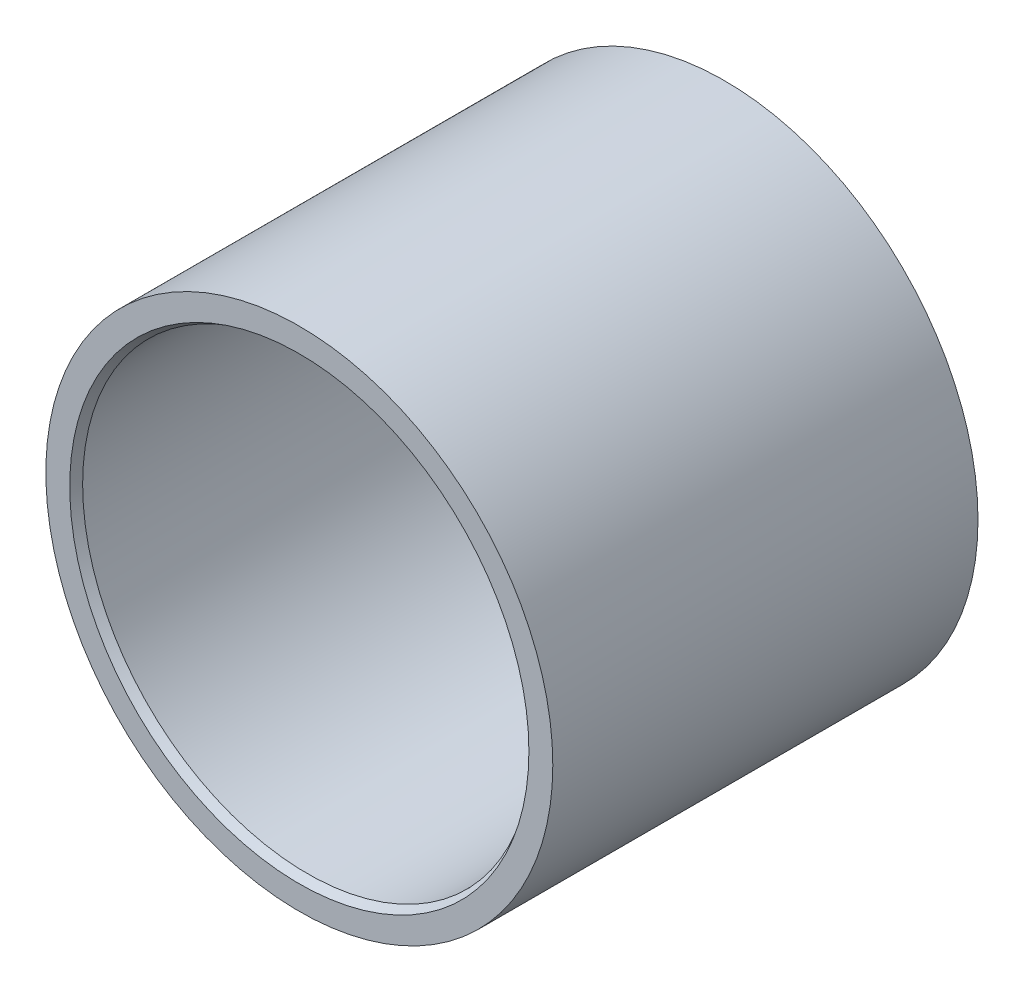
ISO-10303-21;
HEADER;
FILE_DESCRIPTION(('STEP AP214'),'2;1');
FILE_NAME('part.step','',(''),(''),'','','');
FILE_SCHEMA(('AUTOMOTIVE_DESIGN { 1 0 10303 214 1 1 1 1 }'));
ENDSEC;
DATA;
#1=APPLICATION_CONTEXT('core data for automotive mechanical design processes');
#2=APPLICATION_PROTOCOL_DEFINITION('international standard','automotive_design',2000,#1);
#3=PRODUCT_CONTEXT('',#1,'mechanical');
#4=PRODUCT('Part','Part','',(#3));
#5=PRODUCT_RELATED_PRODUCT_CATEGORY('part','',(#4));
#6=PRODUCT_DEFINITION_FORMATION('','',#4);
#7=PRODUCT_DEFINITION_CONTEXT('part definition',#1,'design');
#8=PRODUCT_DEFINITION('design','',#6,#7);
#9=PRODUCT_DEFINITION_SHAPE('','',#8);
#10=(LENGTH_UNIT() NAMED_UNIT(*) SI_UNIT(.MILLI.,.METRE.));
#11=(NAMED_UNIT(*) PLANE_ANGLE_UNIT() SI_UNIT($,.RADIAN.));
#12=(NAMED_UNIT(*) SI_UNIT($,.STERADIAN.) SOLID_ANGLE_UNIT());
#13=UNCERTAINTY_MEASURE_WITH_UNIT(LENGTH_MEASURE(1.E-05),#10,'distance_accuracy_value','');
#14=(GEOMETRIC_REPRESENTATION_CONTEXT(3) GLOBAL_UNCERTAINTY_ASSIGNED_CONTEXT((#13)) GLOBAL_UNIT_ASSIGNED_CONTEXT((#10,
#11,#12)) REPRESENTATION_CONTEXT('',''));
#15=CARTESIAN_POINT('',(0.,0.,0.));
#16=DIRECTION('',(0.,0.,1.));
#17=DIRECTION('',(1.,0.,0.));
#18=AXIS2_PLACEMENT_3D('',#15,#16,#17);
#19=CARTESIAN_POINT('',(0.,27.5,-52.));
#20=DIRECTION('',(0.,0.,1.));
#21=DIRECTION('',(1.,0.,0.));
#22=AXIS2_PLACEMENT_3D('',#19,#20,#21);
#23=PLANE('',#22);
#24=CARTESIAN_POINT('',(0.,0.,-52.));
#25=DIRECTION('',(0.,0.,1.));
#26=DIRECTION('',(1.,0.,0.));
#27=AXIS2_PLACEMENT_3D('',#24,#25,#26);
#28=CIRCLE('',#27,31.);
#29=CARTESIAN_POINT('',(31.,0.,-52.));
#30=VERTEX_POINT('',#29);
#31=EDGE_CURVE('E10',#30,#30,#28,.T.);
#32=ORIENTED_EDGE('',*,*,#31,.F.);
#33=EDGE_LOOP('',(#32));
#34=FACE_BOUND('',#33,.T.);
#35=CARTESIAN_POINT('',(0.,0.,-52.));
#36=DIRECTION('',(0.,0.,1.));
#37=DIRECTION('',(1.,0.,0.));
#38=AXIS2_PLACEMENT_3D('',#35,#36,#37);
#39=CIRCLE('',#38,27.5);
#40=CARTESIAN_POINT('',(27.5,0.,-52.));
#41=VERTEX_POINT('',#40);
#42=EDGE_CURVE('E48',#41,#41,#39,.T.);
#43=ORIENTED_EDGE('',*,*,#42,.T.);
#44=EDGE_LOOP('',(#43));
#45=FACE_BOUND('',#44,.T.);
#46=ADVANCED_FACE('F29',(#34,#45),#23,.F.);
#47=CARTESIAN_POINT('',(0.,0.,0.));
#48=DIRECTION('',(0.,0.,1.));
#49=DIRECTION('',(1.,0.,0.));
#50=AXIS2_PLACEMENT_3D('',#47,#48,#49);
#51=CYLINDRICAL_SURFACE('',#50,31.);
#52=CARTESIAN_POINT('',(0.,0.,0.));
#53=DIRECTION('',(0.,0.,1.));
#54=DIRECTION('',(1.,0.,0.));
#55=AXIS2_PLACEMENT_3D('',#52,#53,#54);
#56=CIRCLE('',#55,31.);
#57=CARTESIAN_POINT('',(31.,0.,0.));
#58=VERTEX_POINT('',#57);
#59=EDGE_CURVE('E35',#58,#58,#56,.T.);
#60=ORIENTED_EDGE('',*,*,#59,.F.);
#61=EDGE_LOOP('',(#60));
#62=FACE_BOUND('',#61,.T.);
#63=ORIENTED_EDGE('',*,*,#31,.T.);
#64=EDGE_LOOP('',(#63));
#65=FACE_BOUND('',#64,.T.);
#66=ADVANCED_FACE('F67',(#62,#65),#51,.T.);
#67=CARTESIAN_POINT('',(0.,31.,0.));
#68=DIRECTION('',(0.,0.,-1.));
#69=DIRECTION('',(-1.,0.,0.));
#70=AXIS2_PLACEMENT_3D('',#67,#68,#69);
#71=PLANE('',#70);
#72=CARTESIAN_POINT('',(0.,0.,0.));
#73=DIRECTION('',(0.,0.,1.));
#74=DIRECTION('',(1.,0.,0.));
#75=AXIS2_PLACEMENT_3D('',#72,#73,#74);
#76=CIRCLE('',#75,28.0773502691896);
#77=CARTESIAN_POINT('',(28.0773502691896,0.,0.));
#78=VERTEX_POINT('',#77);
#79=EDGE_CURVE('E39',#78,#78,#76,.T.);
#80=ORIENTED_EDGE('',*,*,#79,.F.);
#81=EDGE_LOOP('',(#80));
#82=FACE_BOUND('',#81,.T.);
#83=ORIENTED_EDGE('',*,*,#59,.T.);
#84=EDGE_LOOP('',(#83));
#85=FACE_BOUND('',#84,.T.);
#86=ADVANCED_FACE('F62',(#82,#85),#71,.F.);
#87=CARTESIAN_POINT('',(0.,0.,0.));
#88=DIRECTION('',(0.,0.,1.));
#89=DIRECTION('',(1.,0.,0.));
#90=AXIS2_PLACEMENT_3D('',#87,#88,#89);
#91=CONICAL_SURFACE('',#90,28.0773502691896,0.523598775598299);
#92=CARTESIAN_POINT('',(0.,0.,-1.));
#93=DIRECTION('',(0.,0.,1.));
#94=DIRECTION('',(1.,0.,0.));
#95=AXIS2_PLACEMENT_3D('',#92,#93,#94);
#96=CIRCLE('',#95,27.5);
#97=CARTESIAN_POINT('',(27.5,0.,-1.));
#98=VERTEX_POINT('',#97);
#99=EDGE_CURVE('E43',#98,#98,#96,.T.);
#100=ORIENTED_EDGE('',*,*,#99,.F.);
#101=EDGE_LOOP('',(#100));
#102=FACE_BOUND('',#101,.T.);
#103=ORIENTED_EDGE('',*,*,#79,.T.);
#104=EDGE_LOOP('',(#103));
#105=FACE_BOUND('',#104,.T.);
#106=ADVANCED_FACE('F56',(#102,#105),#91,.F.);
#107=CARTESIAN_POINT('',(0.,0.,0.));
#108=DIRECTION('',(0.,0.,1.));
#109=DIRECTION('',(1.,0.,0.));
#110=AXIS2_PLACEMENT_3D('',#107,#108,#109);
#111=CYLINDRICAL_SURFACE('',#110,27.5);
#112=ORIENTED_EDGE('',*,*,#42,.F.);
#113=EDGE_LOOP('',(#112));
#114=FACE_BOUND('',#113,.T.);
#115=ORIENTED_EDGE('',*,*,#99,.T.);
#116=EDGE_LOOP('',(#115));
#117=FACE_BOUND('',#116,.T.);
#118=ADVANCED_FACE('F53',(#114,#117),#111,.F.);
#119=CLOSED_SHELL('',(#46,#66,#86,#106,#118));
#120=MANIFOLD_SOLID_BREP('B2',#119);
#121=ADVANCED_BREP_SHAPE_REPRESENTATION('',(#18,#120),#14);
#122=SHAPE_DEFINITION_REPRESENTATION(#9,#121);
ENDSEC;
END-ISO-10303-21;
